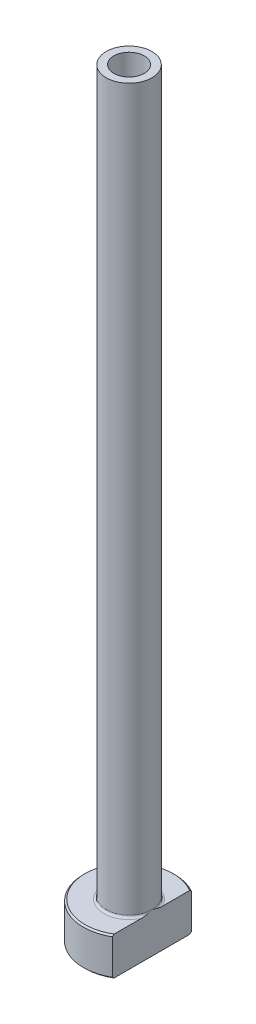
ISO-10303-21;
HEADER;
FILE_DESCRIPTION(('STEP AP214'),'2;1');
FILE_NAME('part.step','',(''),(''),'','','');
FILE_SCHEMA(('AUTOMOTIVE_DESIGN { 1 0 10303 214 1 1 1 1 }'));
ENDSEC;
DATA;
#1=APPLICATION_CONTEXT('core data for automotive mechanical design processes');
#2=APPLICATION_PROTOCOL_DEFINITION('international standard','automotive_design',2000,#1);
#3=PRODUCT_CONTEXT('',#1,'mechanical');
#4=PRODUCT('Part','Part','',(#3));
#5=PRODUCT_RELATED_PRODUCT_CATEGORY('part','',(#4));
#6=PRODUCT_DEFINITION_FORMATION('','',#4);
#7=PRODUCT_DEFINITION_CONTEXT('part definition',#1,'design');
#8=PRODUCT_DEFINITION('design','',#6,#7);
#9=PRODUCT_DEFINITION_SHAPE('','',#8);
#10=(LENGTH_UNIT() NAMED_UNIT(*) SI_UNIT(.MILLI.,.METRE.));
#11=(NAMED_UNIT(*) PLANE_ANGLE_UNIT() SI_UNIT($,.RADIAN.));
#12=(NAMED_UNIT(*) SI_UNIT($,.STERADIAN.) SOLID_ANGLE_UNIT());
#13=UNCERTAINTY_MEASURE_WITH_UNIT(LENGTH_MEASURE(1.E-05),#10,'distance_accuracy_value','');
#14=(GEOMETRIC_REPRESENTATION_CONTEXT(3) GLOBAL_UNCERTAINTY_ASSIGNED_CONTEXT((#13)) GLOBAL_UNIT_ASSIGNED_CONTEXT((#10,
#11,#12)) REPRESENTATION_CONTEXT('',''));
#15=CARTESIAN_POINT('',(0.,0.,0.));
#16=DIRECTION('',(0.,0.,1.));
#17=DIRECTION('',(1.,0.,0.));
#18=AXIS2_PLACEMENT_3D('',#15,#16,#17);
#19=CARTESIAN_POINT('',(0.,92.1876809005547,0.));
#20=DIRECTION('',(0.,1.,0.));
#21=DIRECTION('',(0.,0.,1.));
#22=AXIS2_PLACEMENT_3D('',#19,#20,#21);
#23=CYLINDRICAL_SURFACE('',#22,1.99999999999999);
#24=CARTESIAN_POINT('',(0.,100.,0.));
#25=DIRECTION('',(0.,1.,0.));
#26=DIRECTION('',(0.,0.,1.));
#27=AXIS2_PLACEMENT_3D('',#24,#25,#26);
#28=CIRCLE('',#27,1.99999999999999);
#29=CARTESIAN_POINT('',(0.,100.,1.99999999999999));
#30=VERTEX_POINT('',#29);
#31=EDGE_CURVE('E167',#30,#30,#28,.T.);
#32=ORIENTED_EDGE('',*,*,#31,.T.);
#33=EDGE_LOOP('',(#32));
#34=FACE_BOUND('',#33,.T.);
#35=CARTESIAN_POINT('',(0.,55.,0.));
#36=DIRECTION('',(0.,1.,0.));
#37=DIRECTION('',(0.,0.,1.));
#38=AXIS2_PLACEMENT_3D('',#35,#36,#37);
#39=CIRCLE('',#38,1.99999999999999);
#40=CARTESIAN_POINT('',(0.,55.,1.99999999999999));
#41=VERTEX_POINT('',#40);
#42=EDGE_CURVE('E170',#41,#41,#39,.T.);
#43=ORIENTED_EDGE('',*,*,#42,.F.);
#44=EDGE_LOOP('',(#43));
#45=FACE_BOUND('',#44,.T.);
#46=ADVANCED_FACE('F32',(#34,#45),#23,.F.);
#47=CARTESIAN_POINT('',(-1.99999999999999,100.,0.));
#48=DIRECTION('',(0.,1.,0.));
#49=DIRECTION('',(0.,0.,1.));
#50=AXIS2_PLACEMENT_3D('',#47,#48,#49);
#51=PLANE('',#50);
#52=CARTESIAN_POINT('',(0.,100.,0.));
#53=DIRECTION('',(0.,1.,0.));
#54=DIRECTION('',(0.,0.,1.));
#55=AXIS2_PLACEMENT_3D('',#52,#53,#54);
#56=CIRCLE('',#55,3.);
#57=CARTESIAN_POINT('',(0.,100.,3.));
#58=VERTEX_POINT('',#57);
#59=EDGE_CURVE('E174',#58,#58,#56,.T.);
#60=ORIENTED_EDGE('',*,*,#59,.T.);
#61=EDGE_LOOP('',(#60));
#62=FACE_BOUND('',#61,.T.);
#63=ORIENTED_EDGE('',*,*,#31,.F.);
#64=EDGE_LOOP('',(#63));
#65=FACE_BOUND('',#64,.T.);
#66=ADVANCED_FACE('F157',(#62,#65),#51,.T.);
#67=CARTESIAN_POINT('',(0.,92.1876809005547,0.));
#68=DIRECTION('',(0.,1.,0.));
#69=DIRECTION('',(0.,0.,1.));
#70=AXIS2_PLACEMENT_3D('',#67,#68,#69);
#71=CYLINDRICAL_SURFACE('',#70,3.);
#72=CARTESIAN_POINT('',(0.,5.3,0.));
#73=DIRECTION('',(0.,1.,0.));
#74=DIRECTION('',(0.,0.,1.));
#75=AXIS2_PLACEMENT_3D('',#72,#73,#74);
#76=CIRCLE('',#75,3.);
#77=CARTESIAN_POINT('',(3.,5.3,0.));
#78=VERTEX_POINT('',#77);
#79=EDGE_CURVE('E180',#78,#78,#76,.T.);
#80=ORIENTED_EDGE('',*,*,#79,.T.);
#81=EDGE_LOOP('',(#80));
#82=FACE_BOUND('',#81,.T.);
#83=ORIENTED_EDGE('',*,*,#59,.F.);
#84=EDGE_LOOP('',(#83));
#85=FACE_BOUND('',#84,.T.);
#86=ADVANCED_FACE('F162',(#82,#85),#71,.T.);
#87=CARTESIAN_POINT('',(-2.99999999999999,5.,0.));
#88=DIRECTION('',(0.,1.,0.));
#89=DIRECTION('',(0.,0.,1.));
#90=AXIS2_PLACEMENT_3D('',#87,#88,#89);
#91=PLANE('',#90);
#92=DIRECTION('',(0.,0.,1.));
#93=VECTOR('',#92,1.);
#94=CARTESIAN_POINT('',(2.99999999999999,5.,0.));
#95=LINE('',#94,#93);
#96=CARTESIAN_POINT('',(3.,5.,-4.96386945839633));
#97=VERTEX_POINT('',#96);
#98=CARTESIAN_POINT('',(2.99999999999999,5.,-1.37477270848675));
#99=VERTEX_POINT('',#98);
#100=EDGE_CURVE('E54',#97,#99,#95,.T.);
#101=ORIENTED_EDGE('',*,*,#100,.F.);
#102=CARTESIAN_POINT('',(0.,5.,0.));
#103=DIRECTION('',(0.,1.,0.));
#104=DIRECTION('',(0.,0.,1.));
#105=AXIS2_PLACEMENT_3D('',#102,#103,#104);
#106=CIRCLE('',#105,5.79999999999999);
#107=CARTESIAN_POINT('',(2.99999999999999,5.,4.96386945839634));
#108=VERTEX_POINT('',#107);
#109=EDGE_CURVE('E186',#97,#108,#106,.T.);
#110=ORIENTED_EDGE('',*,*,#109,.T.);
#111=CARTESIAN_POINT('',(2.99999999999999,5.,1.37477270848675));
#112=VERTEX_POINT('',#111);
#113=EDGE_CURVE('E134',#112,#108,#95,.T.);
#114=ORIENTED_EDGE('',*,*,#113,.F.);
#115=CARTESIAN_POINT('',(0.,5.,0.));
#116=DIRECTION('',(0.,1.,0.));
#117=DIRECTION('',(0.,0.,1.));
#118=AXIS2_PLACEMENT_3D('',#115,#116,#117);
#119=CIRCLE('',#118,3.3);
#120=EDGE_CURVE('E183',#112,#99,#119,.F.);
#121=ORIENTED_EDGE('',*,*,#120,.T.);
#122=EDGE_LOOP('',(#101,#110,#114,#121));
#123=FACE_BOUND('',#122,.T.);
#124=ADVANCED_FACE('F197',(#123),#91,.T.);
#125=CARTESIAN_POINT('',(0.,92.1876809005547,0.));
#126=DIRECTION('',(0.,1.,0.));
#127=DIRECTION('',(0.,0.,1.));
#128=AXIS2_PLACEMENT_3D('',#125,#126,#127);
#129=CYLINDRICAL_SURFACE('',#128,5.99999999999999);
#130=DIRECTION('',(0.,-1.,0.));
#131=VECTOR('',#130,1.);
#132=CARTESIAN_POINT('',(2.99999999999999,100.,5.19615242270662));
#133=LINE('',#132,#131);
#134=CARTESIAN_POINT('',(2.99999999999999,4.8,5.19615242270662));
#135=VERTEX_POINT('',#134);
#136=CARTESIAN_POINT('',(2.99999999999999,0.199999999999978,5.19615242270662));
#137=VERTEX_POINT('',#136);
#138=EDGE_CURVE('E82',#135,#137,#133,.T.);
#139=ORIENTED_EDGE('',*,*,#138,.F.);
#140=CARTESIAN_POINT('',(0.,4.8,0.));
#141=DIRECTION('',(0.,1.,0.));
#142=DIRECTION('',(0.,0.,1.));
#143=AXIS2_PLACEMENT_3D('',#140,#141,#142);
#144=CIRCLE('',#143,5.99999999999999);
#145=CARTESIAN_POINT('',(3.,4.8,-5.19615242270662));
#146=VERTEX_POINT('',#145);
#147=EDGE_CURVE('E95',#135,#146,#144,.F.);
#148=ORIENTED_EDGE('',*,*,#147,.T.);
#149=DIRECTION('',(0.,-1.,0.));
#150=VECTOR('',#149,1.);
#151=CARTESIAN_POINT('',(3.,100.,-5.19615242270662));
#152=LINE('',#151,#150);
#153=CARTESIAN_POINT('',(3.,0.199999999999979,-5.19615242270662));
#154=VERTEX_POINT('',#153);
#155=EDGE_CURVE('E192',#146,#154,#152,.T.);
#156=ORIENTED_EDGE('',*,*,#155,.T.);
#157=CARTESIAN_POINT('',(0.,0.199999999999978,0.));
#158=DIRECTION('',(0.,-1.,0.));
#159=DIRECTION('',(0.,0.,-1.));
#160=AXIS2_PLACEMENT_3D('',#157,#158,#159);
#161=CIRCLE('',#160,5.99999999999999);
#162=EDGE_CURVE('E98',#154,#137,#161,.F.);
#163=ORIENTED_EDGE('',*,*,#162,.T.);
#164=EDGE_LOOP('',(#139,#148,#156,#163));
#165=FACE_BOUND('',#164,.T.);
#166=ADVANCED_FACE('F190',(#165),#129,.T.);
#167=CARTESIAN_POINT('',(-5.99999999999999,0.,0.));
#168=DIRECTION('',(0.,-1.,0.));
#169=DIRECTION('',(0.,0.,-1.));
#170=AXIS2_PLACEMENT_3D('',#167,#168,#169);
#171=PLANE('',#170);
#172=CARTESIAN_POINT('',(0.,0.,0.));
#173=DIRECTION('',(0.,-1.,0.));
#174=DIRECTION('',(0.,0.,-1.));
#175=AXIS2_PLACEMENT_3D('',#172,#173,#174);
#176=CIRCLE('',#175,2.74999999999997);
#177=CARTESIAN_POINT('',(0.,0.,-2.74999999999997));
#178=VERTEX_POINT('',#177);
#179=EDGE_CURVE('E40',#178,#178,#176,.F.);
#180=ORIENTED_EDGE('',*,*,#179,.T.);
#181=EDGE_LOOP('',(#180));
#182=FACE_BOUND('',#181,.T.);
#183=DIRECTION('',(0.,0.,-1.));
#184=VECTOR('',#183,1.);
#185=CARTESIAN_POINT('',(2.99999999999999,0.,5.19615242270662));
#186=LINE('',#185,#184);
#187=CARTESIAN_POINT('',(2.99999999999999,0.,4.96386945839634));
#188=VERTEX_POINT('',#187);
#189=CARTESIAN_POINT('',(3.,0.,-4.96386945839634));
#190=VERTEX_POINT('',#189);
#191=EDGE_CURVE('E47',#188,#190,#186,.T.);
#192=ORIENTED_EDGE('',*,*,#191,.F.);
#193=CARTESIAN_POINT('',(0.,0.,0.));
#194=DIRECTION('',(0.,-1.,0.));
#195=DIRECTION('',(0.,0.,-1.));
#196=AXIS2_PLACEMENT_3D('',#193,#194,#195);
#197=CIRCLE('',#196,5.8);
#198=EDGE_CURVE('E92',#188,#190,#197,.T.);
#199=ORIENTED_EDGE('',*,*,#198,.T.);
#200=EDGE_LOOP('',(#192,#199));
#201=FACE_BOUND('',#200,.T.);
#202=ADVANCED_FACE('F91',(#182,#201),#171,.T.);
#203=CARTESIAN_POINT('',(0.,92.1876809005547,0.));
#204=DIRECTION('',(0.,1.,0.));
#205=DIRECTION('',(0.,0.,1.));
#206=AXIS2_PLACEMENT_3D('',#203,#204,#205);
#207=CYLINDRICAL_SURFACE('',#206,2.24999999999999);
#208=CARTESIAN_POINT('',(0.,0.499999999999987,0.));
#209=DIRECTION('',(0.,-1.,0.));
#210=DIRECTION('',(0.,0.,-1.));
#211=AXIS2_PLACEMENT_3D('',#208,#209,#210);
#212=CIRCLE('',#211,2.24999999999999);
#213=CARTESIAN_POINT('',(0.,0.499999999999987,-2.24999999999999));
#214=VERTEX_POINT('',#213);
#215=EDGE_CURVE('E11',#214,#214,#212,.T.);
#216=ORIENTED_EDGE('',*,*,#215,.T.);
#217=EDGE_LOOP('',(#216));
#218=FACE_BOUND('',#217,.T.);
#219=CARTESIAN_POINT('',(0.,43.,0.));
#220=DIRECTION('',(0.,1.,0.));
#221=DIRECTION('',(0.,0.,1.));
#222=AXIS2_PLACEMENT_3D('',#219,#220,#221);
#223=CIRCLE('',#222,2.25);
#224=CARTESIAN_POINT('',(0.,43.,2.25));
#225=VERTEX_POINT('',#224);
#226=EDGE_CURVE('E172',#225,#225,#223,.T.);
#227=ORIENTED_EDGE('',*,*,#226,.T.);
#228=EDGE_LOOP('',(#227));
#229=FACE_BOUND('',#228,.T.);
#230=ADVANCED_FACE('F215',(#218,#229),#207,.F.);
#231=CARTESIAN_POINT('',(0.,43.,0.));
#232=DIRECTION('',(0.,-1.,0.));
#233=DIRECTION('',(0.,0.,-1.));
#234=AXIS2_PLACEMENT_3D('',#231,#232,#233);
#235=CONICAL_SURFACE('',#234,2.25,0.0208303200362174);
#236=ORIENTED_EDGE('',*,*,#42,.T.);
#237=EDGE_LOOP('',(#236));
#238=FACE_BOUND('',#237,.T.);
#239=ORIENTED_EDGE('',*,*,#226,.F.);
#240=EDGE_LOOP('',(#239));
#241=FACE_BOUND('',#240,.T.);
#242=ADVANCED_FACE('F111',(#238,#241),#235,.F.);
#243=CARTESIAN_POINT('',(0.,5.3,0.));
#244=DIRECTION('',(0.,1.,0.));
#245=DIRECTION('',(0.,0.,1.));
#246=AXIS2_PLACEMENT_3D('',#243,#244,#245);
#247=TOROIDAL_SURFACE('',#246,3.3,0.3);
#248=ORIENTED_EDGE('',*,*,#120,.F.);
#249=CARTESIAN_POINT('',(3.,5.3,0.));
#250=CARTESIAN_POINT('',(3.,5.30000062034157,-1.12611132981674E-10));
#251=CARTESIAN_POINT('',(3.,5.30000124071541,1.79706766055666E-07));
#252=CARTESIAN_POINT('',(3.,5.30000241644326,7.12597450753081E-07));
#253=CARTESIAN_POINT('',(3.,5.30000296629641,1.07470896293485E-06));
#254=CARTESIAN_POINT('',(3.,5.30000408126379,1.93940805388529E-06));
#255=CARTESIAN_POINT('',(2.99999999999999,5.30000463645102,2.45488592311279E-06));
#256=CARTESIAN_POINT('',(2.99999999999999,5.30000565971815,3.54465521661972E-06));
#257=CARTESIAN_POINT('',(3.,5.30000612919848,4.11770666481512E-06));
#258=CARTESIAN_POINT('',(3.,5.30000778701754,6.25396436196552E-06));
#259=CARTESIAN_POINT('',(3.,5.30000888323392,7.89070832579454E-06));
#260=CARTESIAN_POINT('',(3.,5.30001076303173,1.11998050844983E-05));
#261=CARTESIAN_POINT('',(3.,5.30001156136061,1.28642110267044E-05));
#262=CARTESIAN_POINT('',(2.99999999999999,5.3000147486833,1.96537168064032E-05));
#263=CARTESIAN_POINT('',(2.99999999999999,5.30001702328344,2.48380233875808E-05));
#264=CARTESIAN_POINT('',(2.99999999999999,5.300020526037,3.48178476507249E-05));
#265=CARTESIAN_POINT('',(3.,5.30002184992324,3.95800620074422E-05));
#266=CARTESIAN_POINT('',(3.,5.30003122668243,7.41814367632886E-05));
#267=CARTESIAN_POINT('',(3.,5.30003808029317,0.00010428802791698));
#268=CARTESIAN_POINT('',(2.99999999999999,5.30006804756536,0.000222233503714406));
#269=CARTESIAN_POINT('',(2.99999999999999,5.30009687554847,0.00030855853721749));
#270=CARTESIAN_POINT('',(3.,5.30020809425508,0.000648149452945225));
#271=CARTESIAN_POINT('',(3.,5.30028657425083,0.00090233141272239));
#272=CARTESIAN_POINT('',(2.99999999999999,5.30059876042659,0.00190491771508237));
#273=CARTESIAN_POINT('',(2.99999999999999,5.30083723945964,0.00265218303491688));
#274=CARTESIAN_POINT('',(3.,5.30182192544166,0.0057469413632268));
#275=CARTESIAN_POINT('',(3.,5.30256224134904,0.00809584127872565));
#276=CARTESIAN_POINT('',(2.99999999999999,5.31160267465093,0.0367678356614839));
#277=CARTESIAN_POINT('',(2.99999999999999,5.31993817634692,0.0630827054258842));
#278=CARTESIAN_POINT('',(3.,5.33621504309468,0.114704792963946));
#279=CARTESIAN_POINT('',(3.,5.34415908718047,0.140011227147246));
#280=CARTESIAN_POINT('',(2.99999999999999,5.36094382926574,0.193774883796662));
#281=CARTESIAN_POINT('',(2.99999999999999,5.36977415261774,0.222235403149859));
#282=CARTESIAN_POINT('',(3.,5.38736474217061,0.279512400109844));
#283=CARTESIAN_POINT('',(3.,5.3961232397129,0.308329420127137));
#284=CARTESIAN_POINT('',(3.,5.41726575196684,0.378880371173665));
#285=CARTESIAN_POINT('',(3.,5.42952723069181,0.420651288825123));
#286=CARTESIAN_POINT('',(3.,5.45309597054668,0.503357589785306));
#287=CARTESIAN_POINT('',(3.,5.46441924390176,0.54428839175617));
#288=CARTESIAN_POINT('',(3.,5.48778169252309,0.632156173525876));
#289=CARTESIAN_POINT('',(3.,5.49969678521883,0.679126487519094));
#290=CARTESIAN_POINT('',(3.,5.52221484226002,0.773740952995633));
#291=CARTESIAN_POINT('',(3.,5.532807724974,0.821387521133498));
#292=CARTESIAN_POINT('',(3.,5.55291503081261,0.920589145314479));
#293=CARTESIAN_POINT('',(3.,5.5622918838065,0.972172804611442));
#294=CARTESIAN_POINT('',(3.,5.57838694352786,1.07574836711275));
#295=CARTESIAN_POINT('',(3.,5.58510535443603,1.12774023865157));
#296=CARTESIAN_POINT('',(3.,5.59681427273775,1.24924411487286));
#297=CARTESIAN_POINT('',(3.,5.60051317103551,1.31890364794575));
#298=CARTESIAN_POINT('',(3.,5.59966579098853,1.42270835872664));
#299=CARTESIAN_POINT('',(3.,5.59835823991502,1.45688093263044));
#300=CARTESIAN_POINT('',(3.,5.59322745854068,1.52502533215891));
#301=CARTESIAN_POINT('',(3.,5.58940645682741,1.55899730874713));
#302=CARTESIAN_POINT('',(3.,5.57976146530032,1.61947815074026));
#303=CARTESIAN_POINT('',(3.,5.57451506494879,1.64607760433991));
#304=CARTESIAN_POINT('',(3.,5.56161153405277,1.69883648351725));
#305=CARTESIAN_POINT('',(3.,5.55394338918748,1.72499331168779));
#306=CARTESIAN_POINT('',(3.,5.53555176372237,1.77650913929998));
#307=CARTESIAN_POINT('',(3.,5.5248003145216,1.80185836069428));
#308=CARTESIAN_POINT('',(3.,5.49948027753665,1.85054545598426));
#309=CARTESIAN_POINT('',(3.,5.48493141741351,1.87389291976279));
#310=CARTESIAN_POINT('',(3.,5.4599247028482,1.90552135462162));
#311=CARTESIAN_POINT('',(3.,5.45133318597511,1.91527363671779));
#312=CARTESIAN_POINT('',(3.,5.43294163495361,1.93360072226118));
#313=CARTESIAN_POINT('',(3.,5.42314083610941,1.94217477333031));
#314=CARTESIAN_POINT('',(3.,5.40215892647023,1.95778354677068));
#315=CARTESIAN_POINT('',(3.,5.39096156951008,1.96479687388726));
#316=CARTESIAN_POINT('',(3.,5.3674214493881,1.97652218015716));
#317=CARTESIAN_POINT('',(3.,5.35508207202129,1.98124071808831));
#318=CARTESIAN_POINT('',(3.,5.33320117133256,1.98690185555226));
#319=CARTESIAN_POINT('',(3.,5.3238355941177,1.98852953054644));
#320=CARTESIAN_POINT('',(3.,5.30496375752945,1.99016898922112));
#321=CARTESIAN_POINT('',(3.,5.29545756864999,1.99018155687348));
#322=CARTESIAN_POINT('',(3.,5.27659318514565,1.9885897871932));
#323=CARTESIAN_POINT('',(3.,5.26723486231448,1.9869869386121));
#324=CARTESIAN_POINT('',(3.,5.24889957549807,1.98229727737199));
#325=CARTESIAN_POINT('',(3.,5.23992286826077,1.97920948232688));
#326=CARTESIAN_POINT('',(3.,5.2198129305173,1.97059641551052));
#327=CARTESIAN_POINT('',(3.,5.20887713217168,1.96461176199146));
#328=CARTESIAN_POINT('',(3.,5.18811536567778,1.9509572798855));
#329=CARTESIAN_POINT('',(3.,5.17829177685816,1.94328393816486));
#330=CARTESIAN_POINT('',(3.,5.15512177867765,1.92254223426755));
#331=CARTESIAN_POINT('',(3.,5.14247568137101,1.90869680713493));
#332=CARTESIAN_POINT('',(3.,5.11944595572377,1.87927587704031));
#333=CARTESIAN_POINT('',(3.,5.10906527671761,1.86369815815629));
#334=CARTESIAN_POINT('',(3.,5.08309609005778,1.81927355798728));
#335=CARTESIAN_POINT('',(3.,5.06948546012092,1.78928084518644));
#336=CARTESIAN_POINT('',(3.,5.04658664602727,1.7275196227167));
#337=CARTESIAN_POINT('',(3.,5.03733582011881,1.6957382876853));
#338=CARTESIAN_POINT('',(3.,5.02214318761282,1.6307991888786));
#339=CARTESIAN_POINT('',(3.,5.01626537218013,1.5976268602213));
#340=CARTESIAN_POINT('',(3.,5.00734002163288,1.5308602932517));
#341=CARTESIAN_POINT('',(3.,5.0042979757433,1.49726536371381));
#342=CARTESIAN_POINT('',(3.,5.00059037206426,1.43100872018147));
#343=CARTESIAN_POINT('',(3.,4.99985343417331,1.39835069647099));
#344=CARTESIAN_POINT('',(3.,5.00019322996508,1.33318312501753));
#345=CARTESIAN_POINT('',(3.,5.00126261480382,1.30067351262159));
#346=CARTESIAN_POINT('',(3.,5.00569854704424,1.22190465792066));
#347=CARTESIAN_POINT('',(3.,5.00984986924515,1.17569031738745));
#348=CARTESIAN_POINT('',(3.,5.02060876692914,1.08357061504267));
#349=CARTESIAN_POINT('',(3.,5.02721586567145,1.0376651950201));
#350=CARTESIAN_POINT('',(3.,5.04258096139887,0.94513016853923));
#351=CARTESIAN_POINT('',(3.,5.05138514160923,0.898508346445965));
#352=CARTESIAN_POINT('',(3.,5.07066869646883,0.805496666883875));
#353=CARTESIAN_POINT('',(3.,5.08115218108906,0.759107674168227));
#354=CARTESIAN_POINT('',(3.,5.10738921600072,0.650207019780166));
#355=CARTESIAN_POINT('',(3.,5.12369110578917,0.587828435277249));
#356=CARTESIAN_POINT('',(3.,5.15777680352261,0.464212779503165));
#357=CARTESIAN_POINT('',(3.,5.17554263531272,0.402970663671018));
#358=CARTESIAN_POINT('',(3.,5.21006724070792,0.287596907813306));
#359=CARTESIAN_POINT('',(3.,5.226717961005,0.233432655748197));
#360=CARTESIAN_POINT('',(3.,5.25241226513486,0.150940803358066));
#361=CARTESIAN_POINT('',(3.,5.26131063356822,0.122567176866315));
#362=CARTESIAN_POINT('',(3.,5.27905176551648,0.0662804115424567));
#363=CARTESIAN_POINT('',(3.,5.28789327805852,0.0383669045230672));
#364=CARTESIAN_POINT('',(3.,5.29743877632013,0.00809257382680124));
#365=CARTESIAN_POINT('',(3.,5.2981801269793,0.00574041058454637));
#366=CARTESIAN_POINT('',(3.,5.29916506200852,0.00264489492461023));
#367=CARTESIAN_POINT('',(3.,5.29940274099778,0.00190013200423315));
#368=CARTESIAN_POINT('',(3.,5.29971394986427,0.000900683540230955));
#369=CARTESIAN_POINT('',(3.,5.29979223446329,0.000647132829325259));
#370=CARTESIAN_POINT('',(3.,5.29990321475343,0.000308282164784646));
#371=CARTESIAN_POINT('',(3.,5.29993200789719,0.000222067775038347));
#372=CARTESIAN_POINT('',(3.,5.29996194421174,0.000104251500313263));
#373=CARTESIAN_POINT('',(3.,5.29996879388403,7.4161420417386E-05));
#374=CARTESIAN_POINT('',(3.,5.29997816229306,3.95766682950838E-05));
#375=CARTESIAN_POINT('',(3.,5.29997948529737,3.48154640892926E-05));
#376=CARTESIAN_POINT('',(3.,5.29998298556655,2.48376258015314E-05));
#377=CARTESIAN_POINT('',(3.,5.2999852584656,1.96542436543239E-05));
#378=CARTESIAN_POINT('',(3.,5.29998844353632,1.28656644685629E-05));
#379=CARTESIAN_POINT('',(3.,5.29998924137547,1.1201333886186E-05));
#380=CARTESIAN_POINT('',(3.,5.29999112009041,7.89229934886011E-06));
#381=CARTESIAN_POINT('',(3.,5.2999922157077,6.25553458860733E-06));
#382=CARTESIAN_POINT('',(3.,5.29999387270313,4.1191431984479E-06));
#383=CARTESIAN_POINT('',(3.,5.29999434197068,3.54603046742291E-06));
#384=CARTESIAN_POINT('',(3.,5.29999536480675,2.45610027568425E-06));
#385=CARTESIAN_POINT('',(3.,5.29999591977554,1.94052194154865E-06));
#386=CARTESIAN_POINT('',(3.,5.29999703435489,1.07558299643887E-06));
#387=CARTESIAN_POINT('',(3.,5.29999758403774,7.13339254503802E-07));
#388=CARTESIAN_POINT('',(3.,5.29999875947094,1.80121860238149E-07));
#389=CARTESIAN_POINT('',(3.,5.29999937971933,1.12600577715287E-10));
#390=CARTESIAN_POINT('',(3.,5.3,0.));
#391=B_SPLINE_CURVE_WITH_KNOTS('',3,(#249,#250,#251,#252,#253,#254,#255,#256,#257,#258,#259,
#260,#261,#262,#263,#264,#265,#266,#267,#268,#269,#270,#271,#272,#273,#274,#275,#276,#277,#278,
#279,#280,#281,#282,#283,#284,#285,#286,#287,#288,#289,#290,#291,#292,#293,#294,#295,#296,#297,
#298,#299,#300,#301,#302,#303,#304,#305,#306,#307,#308,#309,#310,#311,#312,#313,#314,#315,#316,
#317,#318,#319,#320,#321,#322,#323,#324,#325,#326,#327,#328,#329,#330,#331,#332,#333,#334,#335,
#336,#337,#338,#339,#340,#341,#342,#343,#344,#345,#346,#347,#348,#349,#350,#351,#352,#353,#354,
#355,#356,#357,#358,#359,#360,#361,#362,#363,#364,#365,#366,#367,#368,#369,#370,#371,#372,#373,
#374,#375,#376,#377,#378,#379,#380,#381,#382,#383,#384,#385,#386,#387,#388,#389,#390),
.UNSPECIFIED.,.T.,.F.,(4,2,2,2,2,2,2,2,2,2,2,2,2,2,2,2,2,2,2,2,2,2,2,2,2,2,2,2,2,2,2,2,2,2,2,2,
2,2,2,2,2,2,2,2,2,2,2,2,2,2,2,2,2,2,2,2,2,2,2,2,2,2,2,2,2,2,2,2,2,2,4),(0.,1.86513950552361E-06,
3.83353405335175E-06,6.09513446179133E-06,8.31560807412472E-06,1.42000729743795E-05,
1.97335537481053E-05,3.66769900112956E-05,5.14858362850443E-05,0.000144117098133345,
0.000416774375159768,0.00121521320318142,0.00356794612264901,0.010956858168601,
0.0937636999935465,0.173336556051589,0.262732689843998,0.353088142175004,0.483684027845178,
0.61108258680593,0.756439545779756,0.902844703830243,1.06007042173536,1.2172840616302,
1.42611662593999,1.52864191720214,1.63107642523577,1.71232857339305,1.79395571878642,
1.87634808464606,1.95832065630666,1.9972276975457,2.03615946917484,2.07559591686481,
2.11491897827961,2.143309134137,2.17168550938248,2.20003575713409,2.22840478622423,
2.26559554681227,2.30286442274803,2.35880214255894,2.41481225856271,2.5130700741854,
2.61215518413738,2.71306273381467,2.81416520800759,2.91210427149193,3.00964583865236,
3.14875779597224,3.28784276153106,3.43014232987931,3.57279564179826,3.76617940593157,
3.95746724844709,4.12746077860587,4.21667041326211,4.3045074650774,4.31190664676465,
4.31425150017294,4.3150479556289,4.31532026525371,4.31541284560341,4.31542765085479,
4.31544458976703,4.31545012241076,4.31545600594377,4.31545822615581,4.31546048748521,
4.31546245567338,4.31546432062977),.UNSPECIFIED.);
#392=EDGE_CURVE('E126',#112,#78,#391,.T.);
#393=ORIENTED_EDGE('',*,*,#392,.T.);
#394=ORIENTED_EDGE('',*,*,#79,.F.);
#395=CARTESIAN_POINT('',(3.,5.3,0.));
#396=CARTESIAN_POINT('',(3.,5.29999937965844,1.12617569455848E-10));
#397=CARTESIAN_POINT('',(2.99999999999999,5.29999875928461,-1.79706756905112E-07));
#398=CARTESIAN_POINT('',(2.99999999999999,5.2999975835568,-7.12597435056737E-07));
#399=CARTESIAN_POINT('',(2.99999999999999,5.29999703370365,-1.07470894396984E-06));
#400=CARTESIAN_POINT('',(2.99999999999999,5.2999959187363,-1.93940802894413E-06));
#401=CARTESIAN_POINT('',(2.99999999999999,5.29999536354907,-2.45488589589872E-06));
#402=CARTESIAN_POINT('',(2.99999999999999,5.29999434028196,-3.54465518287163E-06));
#403=CARTESIAN_POINT('',(2.99999999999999,5.29999387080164,-4.11770662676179E-06));
#404=CARTESIAN_POINT('',(2.99999999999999,5.2999922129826,-6.25396431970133E-06));
#405=CARTESIAN_POINT('',(2.99999999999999,5.29999111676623,-7.89070828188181E-06));
#406=CARTESIAN_POINT('',(2.99999999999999,5.29998923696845,-1.1199805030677E-05));
#407=CARTESIAN_POINT('',(2.99999999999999,5.29998843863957,-1.28642109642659E-05));
#408=CARTESIAN_POINT('',(2.99999999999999,5.29998525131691,-1.96537167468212E-05));
#409=CARTESIAN_POINT('',(2.99999999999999,5.29998297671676,-2.48380233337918E-05));
#410=CARTESIAN_POINT('',(2.99999999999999,5.29997947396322,-3.48178475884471E-05));
#411=CARTESIAN_POINT('',(3.,5.29997815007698,-3.95800619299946E-05));
#412=CARTESIAN_POINT('',(3.,5.29996877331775,-7.41814367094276E-05));
#413=CARTESIAN_POINT('',(3.,5.2999619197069,-0.000104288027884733));
#414=CARTESIAN_POINT('',(2.99999999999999,5.29993195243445,-0.000222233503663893));
#415=CARTESIAN_POINT('',(2.99999999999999,5.29990312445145,-0.000308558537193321));
#416=CARTESIAN_POINT('',(3.,5.29979190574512,-0.000648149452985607));
#417=CARTESIAN_POINT('',(3.,5.29971342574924,-0.00090233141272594));
#418=CARTESIAN_POINT('',(2.99999999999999,5.29940123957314,-0.00190491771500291));
#419=CARTESIAN_POINT('',(2.99999999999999,5.29916276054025,-0.00265218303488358));
#420=CARTESIAN_POINT('',(3.,5.29817807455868,-0.00574694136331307));
#421=CARTESIAN_POINT('',(3.,5.29743775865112,-0.00809584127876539));
#422=CARTESIAN_POINT('',(2.99999999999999,5.28839732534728,-0.0367678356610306));
#423=CARTESIAN_POINT('',(2.99999999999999,5.28006182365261,-0.0630827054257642));
#424=CARTESIAN_POINT('',(3.,5.26378495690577,-0.114704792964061));
#425=CARTESIAN_POINT('',(3.,5.25584091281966,-0.140011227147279));
#426=CARTESIAN_POINT('',(2.99999999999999,5.23905617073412,-0.193774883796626));
#427=CARTESIAN_POINT('',(2.99999999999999,5.23022584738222,-0.22223540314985));
#428=CARTESIAN_POINT('',(3.,5.21263525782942,-0.279512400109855));
#429=CARTESIAN_POINT('',(3.,5.20387676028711,-0.308329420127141));
#430=CARTESIAN_POINT('',(3.,5.18273424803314,-0.378880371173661));
#431=CARTESIAN_POINT('',(3.,5.17047276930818,-0.420651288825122));
#432=CARTESIAN_POINT('',(3.,5.14690402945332,-0.503357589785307));
#433=CARTESIAN_POINT('',(3.,5.13558075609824,-0.54428839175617));
#434=CARTESIAN_POINT('',(3.,5.1122183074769,-0.632156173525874));
#435=CARTESIAN_POINT('',(3.,5.10030321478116,-0.679126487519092));
#436=CARTESIAN_POINT('',(3.,5.07778515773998,-0.773740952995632));
#437=CARTESIAN_POINT('',(3.,5.067192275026,-0.821387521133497));
#438=CARTESIAN_POINT('',(3.,5.04708496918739,-0.920589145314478));
#439=CARTESIAN_POINT('',(3.,5.0377081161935,-0.972172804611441));
#440=CARTESIAN_POINT('',(3.,5.02161305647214,-1.07574836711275));
#441=CARTESIAN_POINT('',(3.,5.01489464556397,-1.12774023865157));
#442=CARTESIAN_POINT('',(3.,5.00318572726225,-1.24924411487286));
#443=CARTESIAN_POINT('',(3.,4.99948682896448,-1.31890364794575));
#444=CARTESIAN_POINT('',(3.,5.00033420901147,-1.42270835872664));
#445=CARTESIAN_POINT('',(3.,5.00164176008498,-1.45688093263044));
#446=CARTESIAN_POINT('',(3.,5.00677254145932,-1.52502533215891));
#447=CARTESIAN_POINT('',(3.,5.01059354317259,-1.55899730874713));
#448=CARTESIAN_POINT('',(3.,5.02023853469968,-1.61947815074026));
#449=CARTESIAN_POINT('',(3.,5.0254849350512,-1.64607760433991));
#450=CARTESIAN_POINT('',(3.,5.03838846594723,-1.69883648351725));
#451=CARTESIAN_POINT('',(3.,5.04605661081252,-1.72499331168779));
#452=CARTESIAN_POINT('',(3.,5.06444823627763,-1.77650913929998));
#453=CARTESIAN_POINT('',(3.,5.0751996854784,-1.80185836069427));
#454=CARTESIAN_POINT('',(3.,5.10051972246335,-1.85054545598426));
#455=CARTESIAN_POINT('',(3.,5.11506858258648,-1.87389291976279));
#456=CARTESIAN_POINT('',(3.,5.14007529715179,-1.90552135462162));
#457=CARTESIAN_POINT('',(3.,5.14866681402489,-1.91527363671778));
#458=CARTESIAN_POINT('',(3.,5.16705836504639,-1.93360072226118));
#459=CARTESIAN_POINT('',(3.,5.17685916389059,-1.94217477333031));
#460=CARTESIAN_POINT('',(3.,5.19784107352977,-1.95778354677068));
#461=CARTESIAN_POINT('',(3.,5.20903843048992,-1.96479687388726));
#462=CARTESIAN_POINT('',(3.,5.2325785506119,-1.97652218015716));
#463=CARTESIAN_POINT('',(3.,5.2449179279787,-1.98124071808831));
#464=CARTESIAN_POINT('',(3.,5.26679882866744,-1.98690185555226));
#465=CARTESIAN_POINT('',(3.,5.27616440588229,-1.98852953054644));
#466=CARTESIAN_POINT('',(3.,5.29503624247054,-1.99016898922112));
#467=CARTESIAN_POINT('',(3.,5.30454243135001,-1.99018155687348));
#468=CARTESIAN_POINT('',(3.,5.32340681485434,-1.9885897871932));
#469=CARTESIAN_POINT('',(3.,5.33276513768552,-1.9869869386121));
#470=CARTESIAN_POINT('',(3.,5.35110042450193,-1.98229727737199));
#471=CARTESIAN_POINT('',(3.,5.36007713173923,-1.97920948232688));
#472=CARTESIAN_POINT('',(3.,5.3801870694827,-1.97059641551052));
#473=CARTESIAN_POINT('',(3.,5.39112286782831,-1.96461176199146));
#474=CARTESIAN_POINT('',(3.,5.41188463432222,-1.9509572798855));
#475=CARTESIAN_POINT('',(3.,5.42170822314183,-1.94328393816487));
#476=CARTESIAN_POINT('',(3.,5.44487822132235,-1.92254223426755));
#477=CARTESIAN_POINT('',(3.,5.45752431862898,-1.90869680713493));
#478=CARTESIAN_POINT('',(3.,5.48055404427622,-1.87927587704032));
#479=CARTESIAN_POINT('',(3.,5.49093472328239,-1.86369815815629));
#480=CARTESIAN_POINT('',(3.,5.51690390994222,-1.81927355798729));
#481=CARTESIAN_POINT('',(3.,5.53051453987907,-1.78928084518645));
#482=CARTESIAN_POINT('',(3.,5.55341335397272,-1.72751962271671));
#483=CARTESIAN_POINT('',(3.,5.56266417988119,-1.69573828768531));
#484=CARTESIAN_POINT('',(3.,5.57785681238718,-1.6307991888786));
#485=CARTESIAN_POINT('',(3.,5.58373462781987,-1.59762686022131));
#486=CARTESIAN_POINT('',(3.,5.59265997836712,-1.53086029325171));
#487=CARTESIAN_POINT('',(3.,5.59570202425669,-1.49726536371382));
#488=CARTESIAN_POINT('',(3.,5.59940962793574,-1.43100872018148));
#489=CARTESIAN_POINT('',(3.,5.60014656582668,-1.398350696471));
#490=CARTESIAN_POINT('',(3.,5.59980677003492,-1.33318312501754));
#491=CARTESIAN_POINT('',(3.,5.59873738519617,-1.30067351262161));
#492=CARTESIAN_POINT('',(3.,5.59430145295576,-1.22190465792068));
#493=CARTESIAN_POINT('',(3.,5.59015013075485,-1.17569031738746));
#494=CARTESIAN_POINT('',(3.,5.57939123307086,-1.08357061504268));
#495=CARTESIAN_POINT('',(3.,5.57278413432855,-1.03766519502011));
#496=CARTESIAN_POINT('',(3.,5.55741903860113,-0.945130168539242));
#497=CARTESIAN_POINT('',(3.,5.54861485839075,-0.89850834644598));
#498=CARTESIAN_POINT('',(3.,5.52933130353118,-0.805496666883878));
#499=CARTESIAN_POINT('',(3.,5.518847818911,-0.759107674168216));
#500=CARTESIAN_POINT('',(3.,5.49261078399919,-0.650207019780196));
#501=CARTESIAN_POINT('',(3.,5.47630889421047,-0.587828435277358));
#502=CARTESIAN_POINT('',(3.,5.44222319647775,-0.464212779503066));
#503=CARTESIAN_POINT('',(3.,5.42445736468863,-0.402970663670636));
#504=CARTESIAN_POINT('',(2.99999999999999,5.38993275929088,-0.287596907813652));
#505=CARTESIAN_POINT('',(2.99999999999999,5.37328203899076,-0.233432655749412));
#506=CARTESIAN_POINT('',(3.,5.34758773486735,-0.15094080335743));
#507=CARTESIAN_POINT('',(3.,5.33868936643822,-0.122567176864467));
#508=CARTESIAN_POINT('',(2.99999999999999,5.32094823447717,-0.0662804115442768));
#509=CARTESIAN_POINT('',(2.99999999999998,5.31210672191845,-0.0383669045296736));
#510=CARTESIAN_POINT('',(3.,5.30256122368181,-0.00809257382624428));
#511=CARTESIAN_POINT('',(3.,5.30181987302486,-0.00574041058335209));
#512=CARTESIAN_POINT('',(2.99999999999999,5.30083493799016,-0.00264489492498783));
#513=CARTESIAN_POINT('',(2.99999999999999,5.30059725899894,-0.00190013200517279));
#514=CARTESIAN_POINT('',(3.,5.30028605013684,-0.000900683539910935));
#515=CARTESIAN_POINT('',(3.,5.30020776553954,-0.000647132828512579));
#516=CARTESIAN_POINT('',(2.99999999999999,5.30009678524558,-0.000308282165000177));
#517=CARTESIAN_POINT('',(2.99999999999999,5.30006799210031,-0.000222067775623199));
#518=CARTESIAN_POINT('',(3.,5.30003805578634,-0.000104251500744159));
#519=CARTESIAN_POINT('',(3.,5.30003120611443,-7.41614207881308E-05));
#520=CARTESIAN_POINT('',(3.,5.30002183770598,-3.95766685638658E-05));
#521=CARTESIAN_POINT('',(2.99999999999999,5.30002051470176,-3.48154643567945E-05));
#522=CARTESIAN_POINT('',(2.99999999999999,5.30001701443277,-2.48376260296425E-05));
#523=CARTESIAN_POINT('',(2.99999999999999,5.30001474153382,-1.96542438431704E-05));
#524=CARTESIAN_POINT('',(2.99999999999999,5.30001155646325,-1.28656646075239E-05));
#525=CARTESIAN_POINT('',(2.99999999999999,5.30001075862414,-1.12013340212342E-05));
#526=CARTESIAN_POINT('',(2.99999999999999,5.30000887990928,-7.89229946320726E-06));
#527=CARTESIAN_POINT('',(2.99999999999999,5.30000778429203,-6.2555346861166E-06));
#528=CARTESIAN_POINT('',(2.99999999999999,5.30000612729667,-4.11914327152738E-06));
#529=CARTESIAN_POINT('',(2.99999999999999,5.30000565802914,-3.54603053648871E-06));
#530=CARTESIAN_POINT('',(2.99999999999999,5.30000463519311,-2.45610033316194E-06));
#531=CARTESIAN_POINT('',(2.99999999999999,5.30000408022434,-1.94052199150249E-06));
#532=CARTESIAN_POINT('',(2.99999999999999,5.30000296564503,-1.07558303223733E-06));
#533=CARTESIAN_POINT('',(2.99999999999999,5.30000241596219,-7.13339283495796E-07));
#534=CARTESIAN_POINT('',(2.99999999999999,5.30000124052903,-1.80121874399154E-07));
#535=CARTESIAN_POINT('',(3.,5.30000062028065,-1.12606011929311E-10));
#536=CARTESIAN_POINT('',(3.,5.3,0.));
#537=B_SPLINE_CURVE_WITH_KNOTS('',3,(#395,#396,#397,#398,#399,#400,#401,#402,#403,#404,#405,
#406,#407,#408,#409,#410,#411,#412,#413,#414,#415,#416,#417,#418,#419,#420,#421,#422,#423,#424,
#425,#426,#427,#428,#429,#430,#431,#432,#433,#434,#435,#436,#437,#438,#439,#440,#441,#442,#443,
#444,#445,#446,#447,#448,#449,#450,#451,#452,#453,#454,#455,#456,#457,#458,#459,#460,#461,#462,
#463,#464,#465,#466,#467,#468,#469,#470,#471,#472,#473,#474,#475,#476,#477,#478,#479,#480,#481,
#482,#483,#484,#485,#486,#487,#488,#489,#490,#491,#492,#493,#494,#495,#496,#497,#498,#499,#500,
#501,#502,#503,#504,#505,#506,#507,#508,#509,#510,#511,#512,#513,#514,#515,#516,#517,#518,#519,
#520,#521,#522,#523,#524,#525,#526,#527,#528,#529,#530,#531,#532,#533,#534,#535,#536),
.UNSPECIFIED.,.T.,.F.,(4,2,2,2,2,2,2,2,2,2,2,2,2,2,2,2,2,2,2,2,2,2,2,2,2,2,2,2,2,2,2,2,2,2,2,2,
2,2,2,2,2,2,2,2,2,2,2,2,2,2,2,2,2,2,2,2,2,2,2,2,2,2,2,2,2,2,2,2,2,2,4),(0.,1.86513946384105E-06,
3.83353397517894E-06,6.09513435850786E-06,8.31560794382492E-06,1.42000728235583E-05,
1.9733553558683E-05,3.66769898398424E-05,5.14858360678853E-05,0.000144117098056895,
0.000416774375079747,0.00121521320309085,0.00356794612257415,0.0109568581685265,
0.0937636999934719,0.173336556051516,0.262732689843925,0.35308814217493,0.483684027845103,
0.611082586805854,0.756439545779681,0.902844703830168,1.06007042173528,1.21728406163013,
1.42611662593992,1.52864191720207,1.63107642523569,1.71232857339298,1.79395571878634,
1.87634808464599,1.95832065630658,1.99722769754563,2.03615946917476,2.07559591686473,
2.11491897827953,2.14330913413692,2.1716855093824,2.20003575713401,2.22840478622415,
2.26559554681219,2.30286442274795,2.35880214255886,2.41481225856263,2.51307007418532,
2.6121551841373,2.71306273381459,2.8141652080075,2.91210427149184,3.00964583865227,
3.14875779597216,3.28784276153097,3.43014232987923,3.57279564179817,3.7661794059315,
3.95746724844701,4.12746077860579,4.21667041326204,4.30450746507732,4.31190664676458,
4.31425150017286,4.31504795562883,4.31532026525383,4.31541284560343,4.31542765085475,
4.31544458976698,4.31545012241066,4.31545600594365,4.31545822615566,4.31546048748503,
4.31546245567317,4.31546432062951),.UNSPECIFIED.);
#538=EDGE_CURVE('E135',#78,#99,#537,.T.);
#539=ORIENTED_EDGE('',*,*,#538,.T.);
#540=EDGE_LOOP('',(#248,#393,#394,#539));
#541=FACE_BOUND('',#540,.T.);
#542=ADVANCED_FACE('F141',(#541),#247,.F.);
#543=CARTESIAN_POINT('',(0.,5.,0.));
#544=DIRECTION('',(0.,-1.,0.));
#545=DIRECTION('',(0.,0.,-1.));
#546=AXIS2_PLACEMENT_3D('',#543,#544,#545);
#547=CONICAL_SURFACE('',#546,5.79999999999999,0.785398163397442);
#548=CARTESIAN_POINT('',(3.,-1.01993959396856,-11.432889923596));
#549=CARTESIAN_POINT('',(3.,-0.769424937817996,-11.1738796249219));
#550=CARTESIAN_POINT('',(3.,-0.519179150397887,-10.9146084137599));
#551=CARTESIAN_POINT('',(3.,-0.019384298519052,-10.395389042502));
#552=CARTESIAN_POINT('',(3.,0.230164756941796,-10.1354408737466));
#553=CARTESIAN_POINT('',(3.,0.728528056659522,-9.61458602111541));
#554=CARTESIAN_POINT('',(3.,0.977341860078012,-9.35367891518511));
#555=CARTESIAN_POINT('',(3.,1.47386965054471,-8.83082274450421));
#556=CARTESIAN_POINT('',(3.,1.72158364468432,-8.56887368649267));
#557=CARTESIAN_POINT('',(3.,2.21069282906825,-8.04884148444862));
#558=CARTESIAN_POINT('',(3.,2.45211594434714,-7.7907846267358));
#559=CARTESIAN_POINT('',(3.,2.93315589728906,-7.27299342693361));
#560=CARTESIAN_POINT('',(3.,3.17277274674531,-7.01325909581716));
#561=CARTESIAN_POINT('',(3.,3.64950020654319,-6.49159990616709));
#562=CARTESIAN_POINT('',(3.,3.88661134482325,-6.22967553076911));
#563=CARTESIAN_POINT('',(3.,4.35738571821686,-5.70275148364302));
#564=CARTESIAN_POINT('',(3.,4.59104909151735,-5.43775193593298));
#565=CARTESIAN_POINT('',(3.,4.96416348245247,-5.00636825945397));
#566=CARTESIAN_POINT('',(3.,5.10520133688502,-4.84135845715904));
#567=CARTESIAN_POINT('',(3.,5.38476673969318,-4.50919282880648));
#568=CARTESIAN_POINT('',(3.,5.52329404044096,-4.342036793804));
#569=CARTESIAN_POINT('',(3.,5.79842961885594,-4.00319933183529));
#570=CARTESIAN_POINT('',(3.,5.93500216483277,-3.83148875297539));
#571=CARTESIAN_POINT('',(3.,6.20336281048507,-3.48442112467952));
#572=CARTESIAN_POINT('',(3.,6.33515205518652,-3.30906496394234));
#573=CARTESIAN_POINT('',(3.,6.59393382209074,-2.95070802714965));
#574=CARTESIAN_POINT('',(3.,6.72082315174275,-2.76763161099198));
#575=CARTESIAN_POINT('',(3.,6.90336321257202,-2.48771743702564));
#576=CARTESIAN_POINT('',(3.,6.96295431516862,-2.39345390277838));
#577=CARTESIAN_POINT('',(3.,7.07882720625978,-2.20292146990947));
#578=CARTESIAN_POINT('',(3.,7.13510937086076,-2.10665280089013));
#579=CARTESIAN_POINT('',(3.,7.24288059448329,-1.91297779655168));
#580=CARTESIAN_POINT('',(3.,7.29441986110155,-1.81559978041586));
#581=CARTESIAN_POINT('',(3.,7.39241237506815,-1.61833215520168));
#582=CARTESIAN_POINT('',(3.,7.43886469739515,-1.51844209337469));
#583=CARTESIAN_POINT('',(3.,7.56840030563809,-1.21511948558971));
#584=CARTESIAN_POINT('',(3.,7.64209011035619,-1.00730397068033));
#585=CARTESIAN_POINT('',(3.,7.72186700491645,-0.695731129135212));
#586=CARTESIAN_POINT('',(3.,7.7430290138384,-0.595791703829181));
#587=CARTESIAN_POINT('',(3.,7.77582528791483,-0.39432596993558));
#588=CARTESIAN_POINT('',(3.,7.78746040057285,-0.292799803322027));
#589=CARTESIAN_POINT('',(3.,7.80037895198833,-0.0893987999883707));
#590=CARTESIAN_POINT('',(3.,7.80169449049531,0.0124739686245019));
#591=CARTESIAN_POINT('',(3.,7.79396363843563,0.215826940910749));
#592=CARTESIAN_POINT('',(3.,7.78491639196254,0.317307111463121));
#593=CARTESIAN_POINT('',(3.,7.75721241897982,0.518039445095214));
#594=CARTESIAN_POINT('',(3.,7.73863812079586,0.617303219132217));
#595=CARTESIAN_POINT('',(3.,7.69303955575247,0.813850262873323));
#596=CARTESIAN_POINT('',(3.,7.66601427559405,0.911133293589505));
#597=CARTESIAN_POINT('',(3.,7.60464499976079,1.10394843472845));
#598=CARTESIAN_POINT('',(3.,7.57025976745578,1.19946724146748));
#599=CARTESIAN_POINT('',(3.,7.4955576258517,1.38810736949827));
#600=CARTESIAN_POINT('',(3.,7.45524192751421,1.48122917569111));
#601=CARTESIAN_POINT('',(3.,7.36961028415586,1.66561491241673));
#602=CARTESIAN_POINT('',(3.,7.32427350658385,1.75686908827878));
#603=CARTESIAN_POINT('',(3.,7.2296607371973,1.93732130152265));
#604=CARTESIAN_POINT('',(3.,7.18038388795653,2.02651888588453));
#605=CARTESIAN_POINT('',(3.,7.02771106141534,2.29153460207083));
#606=CARTESIAN_POINT('',(2.99999999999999,6.91955486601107,2.46460625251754));
#607=CARTESIAN_POINT('',(2.99999999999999,6.69440299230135,2.80577028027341));
#608=CARTESIAN_POINT('',(2.99999999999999,6.57737415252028,2.97384034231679));
#609=CARTESIAN_POINT('',(2.99999999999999,6.33748949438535,3.30561771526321));
#610=CARTESIAN_POINT('',(2.99999999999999,6.21463662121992,3.46932716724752));
#611=CARTESIAN_POINT('',(2.99999999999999,5.96308085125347,3.79561670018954));
#612=CARTESIAN_POINT('',(2.99999999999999,5.83432224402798,3.95815356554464));
#613=CARTESIAN_POINT('',(2.99999999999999,5.573613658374,4.28066737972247));
#614=CARTESIAN_POINT('',(2.99999999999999,5.44166333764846,4.44064405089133));
#615=CARTESIAN_POINT('',(2.99999999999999,5.17568445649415,4.7581955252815));
#616=CARTESIAN_POINT('',(2.99999999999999,5.04166171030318,4.91577521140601));
#617=CARTESIAN_POINT('',(2.99999999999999,4.77176230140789,5.22934053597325));
#618=CARTESIAN_POINT('',(2.99999999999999,4.63588560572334,5.38532614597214));
#619=CARTESIAN_POINT('',(2.99999999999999,4.27256222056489,5.79849838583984));
#620=CARTESIAN_POINT('',(2.99999999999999,4.04384014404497,6.054562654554));
#621=CARTESIAN_POINT('',(2.99999999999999,3.58360020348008,6.56417037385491));
#622=CARTESIAN_POINT('',(2.99999999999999,3.35208226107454,6.81771375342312));
#623=CARTESIAN_POINT('',(2.99999999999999,2.88678846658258,7.32315936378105));
#624=CARTESIAN_POINT('',(2.99999999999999,2.65301069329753,7.57505982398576));
#625=CARTESIAN_POINT('',(2.99999999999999,2.18392232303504,8.07742926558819));
#626=CARTESIAN_POINT('',(2.99999999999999,1.94861172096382,8.3278982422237));
#627=CARTESIAN_POINT('',(2.99999999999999,1.48651581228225,8.81743943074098));
#628=CARTESIAN_POINT('',(2.99999999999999,1.2597780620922,9.0565565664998));
#629=CARTESIAN_POINT('',(2.99999999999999,0.80543969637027,9.53397105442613));
#630=CARTESIAN_POINT('',(2.99999999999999,0.577839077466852,9.77226840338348));
#631=CARTESIAN_POINT('',(2.99999999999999,0.122198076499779,10.2479325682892));
#632=CARTESIAN_POINT('',(2.99999999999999,-0.105841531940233,10.4853001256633));
#633=CARTESIAN_POINT('',(2.99999999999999,-0.562491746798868,10.9594816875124));
#634=CARTESIAN_POINT('',(2.99999999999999,-0.791102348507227,11.1962956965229));
#635=CARTESIAN_POINT('',(2.99999999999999,-1.01993959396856,11.432889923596));
#636=B_SPLINE_CURVE_WITH_KNOTS('',3,(#548,#549,#550,#551,#552,#553,#554,#555,#556,#557,#558,
#559,#560,#561,#562,#563,#564,#565,#566,#567,#568,#569,#570,#571,#572,#573,#574,#575,#576,#577,
#578,#579,#580,#581,#582,#583,#584,#585,#586,#587,#588,#589,#590,#591,#592,#593,#594,#595,#596,
#597,#598,#599,#600,#601,#602,#603,#604,#605,#606,#607,#608,#609,#610,#611,#612,#613,#614,#615,
#616,#617,#618,#619,#620,#621,#622,#623,#624,#625,#626,#627,#628,#629,#630,#631,#632,#633,#634,
#635),.UNSPECIFIED.,.F.,.F.,(4,2,2,2,2,2,2,2,2,2,2,2,2,2,2,2,2,2,2,2,2,2,2,2,2,2,2,2,2,2,2,2,2,
2,2,2,2,2,2,2,2,2,2,4),(0.,1.08101662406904,2.1620471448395,3.24363027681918,4.32520642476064,
5.38534462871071,6.44547590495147,7.50537917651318,8.56523985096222,9.21643479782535,
9.86769362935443,10.5258323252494,11.1838124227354,11.8517813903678,12.1862877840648,
12.5207560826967,12.8511332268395,13.1815703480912,13.8399161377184,14.1460077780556,
14.4520721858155,14.7571841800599,15.0623213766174,15.3648619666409,15.6674388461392,
15.9717575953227,16.2760142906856,16.5815843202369,16.8872210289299,17.4990577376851,
18.1133060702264,18.7272470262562,19.3492675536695,19.9713550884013,20.5919343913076,
21.2125247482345,22.2425132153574,23.2725306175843,24.3035181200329,25.3345090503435,
26.3230827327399,27.3116602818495,28.299135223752,29.2866020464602),.UNSPECIFIED.);
#637=EDGE_CURVE('E133',#146,#97,#636,.T.);
#638=ORIENTED_EDGE('',*,*,#637,.F.);
#639=ORIENTED_EDGE('',*,*,#147,.F.);
#640=EDGE_CURVE('E118',#108,#135,#636,.T.);
#641=ORIENTED_EDGE('',*,*,#640,.F.);
#642=ORIENTED_EDGE('',*,*,#109,.F.);
#643=EDGE_LOOP('',(#638,#639,#641,#642));
#644=FACE_BOUND('',#643,.T.);
#645=ADVANCED_FACE('F145',(#644),#547,.T.);
#646=CARTESIAN_POINT('',(0.,0.199999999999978,0.));
#647=DIRECTION('',(0.,1.,0.));
#648=DIRECTION('',(0.,0.,1.));
#649=AXIS2_PLACEMENT_3D('',#646,#647,#648);
#650=CONICAL_SURFACE('',#649,5.99999999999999,0.785398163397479);
#651=CARTESIAN_POINT('',(2.99999999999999,6.01993959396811,11.432889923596));
#652=CARTESIAN_POINT('',(2.99999999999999,5.76942493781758,11.1738796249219));
#653=CARTESIAN_POINT('',(2.99999999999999,5.5191791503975,10.9146084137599));
#654=CARTESIAN_POINT('',(2.99999999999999,5.01938429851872,10.3953890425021));
#655=CARTESIAN_POINT('',(2.99999999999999,4.76983524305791,10.1354408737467));
#656=CARTESIAN_POINT('',(2.99999999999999,4.27147194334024,9.61458602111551));
#657=CARTESIAN_POINT('',(2.99999999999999,4.02265813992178,9.35367891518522));
#658=CARTESIAN_POINT('',(2.99999999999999,3.52613034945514,8.83082274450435));
#659=CARTESIAN_POINT('',(2.99999999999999,3.27841635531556,8.56887368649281));
#660=CARTESIAN_POINT('',(2.99999999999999,2.7893071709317,8.0488414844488));
#661=CARTESIAN_POINT('',(2.99999999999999,2.54788405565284,7.79078462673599));
#662=CARTESIAN_POINT('',(2.99999999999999,2.06684410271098,7.27299342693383));
#663=CARTESIAN_POINT('',(2.99999999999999,1.82722725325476,7.01325909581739));
#664=CARTESIAN_POINT('',(2.99999999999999,1.35049979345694,6.49159990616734));
#665=CARTESIAN_POINT('',(2.99999999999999,1.1133886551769,6.22967553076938));
#666=CARTESIAN_POINT('',(2.99999999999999,0.64261428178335,5.70275148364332));
#667=CARTESIAN_POINT('',(2.99999999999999,0.408950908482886,5.43775193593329));
#668=CARTESIAN_POINT('',(2.99999999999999,0.0358365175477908,5.00636825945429));
#669=CARTESIAN_POINT('',(2.99999999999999,-0.105201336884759,4.84135845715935));
#670=CARTESIAN_POINT('',(2.99999999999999,-0.384766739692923,4.50919282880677));
#671=CARTESIAN_POINT('',(2.99999999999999,-0.523294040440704,4.34203679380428));
#672=CARTESIAN_POINT('',(2.99999999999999,-0.798429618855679,4.00319933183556));
#673=CARTESIAN_POINT('',(2.99999999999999,-0.935002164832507,3.83148875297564));
#674=CARTESIAN_POINT('',(2.99999999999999,-1.20336281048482,3.48442112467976));
#675=CARTESIAN_POINT('',(2.99999999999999,-1.33515205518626,3.30906496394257));
#676=CARTESIAN_POINT('',(2.99999999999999,-1.59393382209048,2.95070802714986));
#677=CARTESIAN_POINT('',(3.,-1.72082315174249,2.76763161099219));
#678=CARTESIAN_POINT('',(3.,-1.90336321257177,2.48771743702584));
#679=CARTESIAN_POINT('',(3.,-1.96295431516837,2.39345390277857));
#680=CARTESIAN_POINT('',(3.,-2.07882720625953,2.20292146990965));
#681=CARTESIAN_POINT('',(3.,-2.13510937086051,2.10665280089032));
#682=CARTESIAN_POINT('',(3.,-2.24288059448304,1.91297779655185));
#683=CARTESIAN_POINT('',(3.,-2.2944198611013,1.81559978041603));
#684=CARTESIAN_POINT('',(3.,-2.3924123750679,1.61833215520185));
#685=CARTESIAN_POINT('',(3.,-2.4388646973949,1.51844209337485));
#686=CARTESIAN_POINT('',(3.,-2.56840030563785,1.21511948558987));
#687=CARTESIAN_POINT('',(3.,-2.64209011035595,1.00730397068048));
#688=CARTESIAN_POINT('',(3.,-2.72186700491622,0.695731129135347));
#689=CARTESIAN_POINT('',(3.,-2.74302901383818,0.595791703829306));
#690=CARTESIAN_POINT('',(3.,-2.77582528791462,0.394325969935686));
#691=CARTESIAN_POINT('',(3.,-2.78746040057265,0.292799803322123));
#692=CARTESIAN_POINT('',(3.,-2.80037895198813,0.0893987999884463));
#693=CARTESIAN_POINT('',(3.,-2.80169449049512,-0.0124739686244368));
#694=CARTESIAN_POINT('',(3.,-2.79396363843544,-0.215826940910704));
#695=CARTESIAN_POINT('',(3.,-2.78491639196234,-0.317307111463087));
#696=CARTESIAN_POINT('',(3.,-2.75721241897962,-0.518039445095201));
#697=CARTESIAN_POINT('',(3.,-2.73863812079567,-0.617303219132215));
#698=CARTESIAN_POINT('',(3.,-2.69303955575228,-0.813850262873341));
#699=CARTESIAN_POINT('',(3.,-2.66601427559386,-0.911133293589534));
#700=CARTESIAN_POINT('',(3.,-2.60464499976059,-1.1039484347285));
#701=CARTESIAN_POINT('',(3.,-2.57025976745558,-1.19946724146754));
#702=CARTESIAN_POINT('',(3.,-2.49555762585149,-1.38810736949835));
#703=CARTESIAN_POINT('',(3.,-2.45524192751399,-1.4812291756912));
#704=CARTESIAN_POINT('',(3.,-2.36961028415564,-1.66561491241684));
#705=CARTESIAN_POINT('',(3.,-2.32427350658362,-1.75686908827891));
#706=CARTESIAN_POINT('',(3.,-2.22966073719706,-1.93732130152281));
#707=CARTESIAN_POINT('',(3.,-2.18038388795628,-2.02651888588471));
#708=CARTESIAN_POINT('',(3.,-2.02771106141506,-2.29153460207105));
#709=CARTESIAN_POINT('',(3.,-1.91955486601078,-2.46460625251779));
#710=CARTESIAN_POINT('',(3.,-1.69440299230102,-2.80577028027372));
#711=CARTESIAN_POINT('',(3.,-1.57737415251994,-2.97384034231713));
#712=CARTESIAN_POINT('',(3.,-1.33748949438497,-3.3056177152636));
#713=CARTESIAN_POINT('',(3.,-1.21463662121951,-3.46932716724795));
#714=CARTESIAN_POINT('',(3.,-0.963080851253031,-3.79561670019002));
#715=CARTESIAN_POINT('',(3.,-0.834322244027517,-3.95815356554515));
#716=CARTESIAN_POINT('',(3.,-0.573613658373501,-4.28066737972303));
#717=CARTESIAN_POINT('',(3.,-0.441663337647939,-4.44064405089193));
#718=CARTESIAN_POINT('',(3.,-0.175684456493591,-4.75819552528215));
#719=CARTESIAN_POINT('',(3.,-0.0416617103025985,-4.91577521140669));
#720=CARTESIAN_POINT('',(3.,0.228237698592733,-5.229340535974));
#721=CARTESIAN_POINT('',(3.,0.364114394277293,-5.38532614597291));
#722=CARTESIAN_POINT('',(3.,0.727437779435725,-5.7984983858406));
#723=CARTESIAN_POINT('',(3.,0.956159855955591,-6.05456265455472));
#724=CARTESIAN_POINT('',(3.,1.41639979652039,-6.56417037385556));
#725=CARTESIAN_POINT('',(3.,1.64791773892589,-6.81771375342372));
#726=CARTESIAN_POINT('',(3.,2.11321153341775,-7.32315936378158));
#727=CARTESIAN_POINT('',(3.,2.34698930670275,-7.57505982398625));
#728=CARTESIAN_POINT('',(3.,2.81607767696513,-8.07742926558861));
#729=CARTESIAN_POINT('',(3.,3.05138827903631,-8.32789824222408));
#730=CARTESIAN_POINT('',(3.,3.51348418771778,-8.81743943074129));
#731=CARTESIAN_POINT('',(3.,3.7402219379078,-9.05655656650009));
#732=CARTESIAN_POINT('',(3.,4.19456030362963,-9.53397105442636));
#733=CARTESIAN_POINT('',(3.,4.42216092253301,-9.77226840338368));
#734=CARTESIAN_POINT('',(3.,4.87780192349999,-10.2479325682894));
#735=CARTESIAN_POINT('',(3.,5.10584153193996,-10.4853001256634));
#736=CARTESIAN_POINT('',(3.,5.5624917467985,-10.9594816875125));
#737=CARTESIAN_POINT('',(3.,5.79110234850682,-11.1962956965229));
#738=CARTESIAN_POINT('',(3.,6.01993959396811,-11.432889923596));
#739=B_SPLINE_CURVE_WITH_KNOTS('',3,(#651,#652,#653,#654,#655,#656,#657,#658,#659,#660,#661,
#662,#663,#664,#665,#666,#667,#668,#669,#670,#671,#672,#673,#674,#675,#676,#677,#678,#679,#680,
#681,#682,#683,#684,#685,#686,#687,#688,#689,#690,#691,#692,#693,#694,#695,#696,#697,#698,#699,
#700,#701,#702,#703,#704,#705,#706,#707,#708,#709,#710,#711,#712,#713,#714,#715,#716,#717,#718,
#719,#720,#721,#722,#723,#724,#725,#726,#727,#728,#729,#730,#731,#732,#733,#734,#735,#736,#737,
#738),.UNSPECIFIED.,.F.,.F.,(4,2,2,2,2,2,2,2,2,2,2,2,2,2,2,2,2,2,2,2,2,2,2,2,2,2,2,2,2,2,2,2,2,
2,2,2,2,2,2,2,2,2,2,4),(0.,1.08101662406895,2.16204714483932,3.2436302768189,4.32520642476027,
5.38534462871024,6.44547590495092,7.50537917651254,8.56523985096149,9.21643479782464,
9.86769362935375,10.5258323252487,11.1838124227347,11.8517813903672,12.1862877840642,
12.5207560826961,12.8511332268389,13.1815703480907,13.8399161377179,14.1460077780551,
14.452072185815,14.7571841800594,15.0623213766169,15.3648619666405,15.6674388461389,
15.9717575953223,16.2760142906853,16.5815843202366,16.8872210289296,17.499057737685,
18.1133060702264,18.7272470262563,19.3492675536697,19.9713550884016,20.591934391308,
21.212524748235,22.2425132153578,23.2725306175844,24.3035181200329,25.3345090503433,
26.3230827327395,27.311660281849,28.2991352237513,29.2866020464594),.UNSPECIFIED.);
#740=EDGE_CURVE('E79',#137,#188,#739,.T.);
#741=ORIENTED_EDGE('',*,*,#740,.F.);
#742=ORIENTED_EDGE('',*,*,#162,.F.);
#743=EDGE_CURVE('E87',#190,#154,#739,.T.);
#744=ORIENTED_EDGE('',*,*,#743,.F.);
#745=ORIENTED_EDGE('',*,*,#198,.F.);
#746=EDGE_LOOP('',(#741,#742,#744,#745));
#747=FACE_BOUND('',#746,.T.);
#748=ADVANCED_FACE('F94',(#747),#650,.T.);
#749=CARTESIAN_POINT('',(2.99999999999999,100.,5.19615242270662));
#750=DIRECTION('',(-1.,0.,0.));
#751=DIRECTION('',(0.,0.,1.));
#752=AXIS2_PLACEMENT_3D('',#749,#750,#751);
#753=PLANE('',#752);
#754=ORIENTED_EDGE('',*,*,#392,.F.);
#755=ORIENTED_EDGE('',*,*,#113,.T.);
#756=ORIENTED_EDGE('',*,*,#640,.T.);
#757=ORIENTED_EDGE('',*,*,#138,.T.);
#758=ORIENTED_EDGE('',*,*,#740,.T.);
#759=ORIENTED_EDGE('',*,*,#191,.T.);
#760=ORIENTED_EDGE('',*,*,#743,.T.);
#761=ORIENTED_EDGE('',*,*,#155,.F.);
#762=ORIENTED_EDGE('',*,*,#637,.T.);
#763=ORIENTED_EDGE('',*,*,#100,.T.);
#764=ORIENTED_EDGE('',*,*,#538,.F.);
#765=EDGE_LOOP('',(#754,#755,#756,#757,#758,#759,#760,#761,#762,#763,#764));
#766=FACE_BOUND('',#765,.T.);
#767=ADVANCED_FACE('F80',(#766),#753,.F.);
#768=CARTESIAN_POINT('',(0.,0.,0.));
#769=DIRECTION('',(0.,-1.,0.));
#770=DIRECTION('',(0.,0.,-1.));
#771=AXIS2_PLACEMENT_3D('',#768,#769,#770);
#772=CONICAL_SURFACE('',#771,2.74999999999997,0.785398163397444);
#773=ORIENTED_EDGE('',*,*,#215,.F.);
#774=EDGE_LOOP('',(#773));
#775=FACE_BOUND('',#774,.T.);
#776=ORIENTED_EDGE('',*,*,#179,.F.);
#777=EDGE_LOOP('',(#776));
#778=FACE_BOUND('',#777,.T.);
#779=ADVANCED_FACE('F34',(#775,#778),#772,.F.);
#780=CLOSED_SHELL('',(#46,#66,#86,#124,#166,#202,#230,#242,#542,#645,#748,#767,#779));
#781=MANIFOLD_SOLID_BREP('B2',#780);
#782=ADVANCED_BREP_SHAPE_REPRESENTATION('',(#18,#781),#14);
#783=SHAPE_DEFINITION_REPRESENTATION(#9,#782);
ENDSEC;
END-ISO-10303-21;
